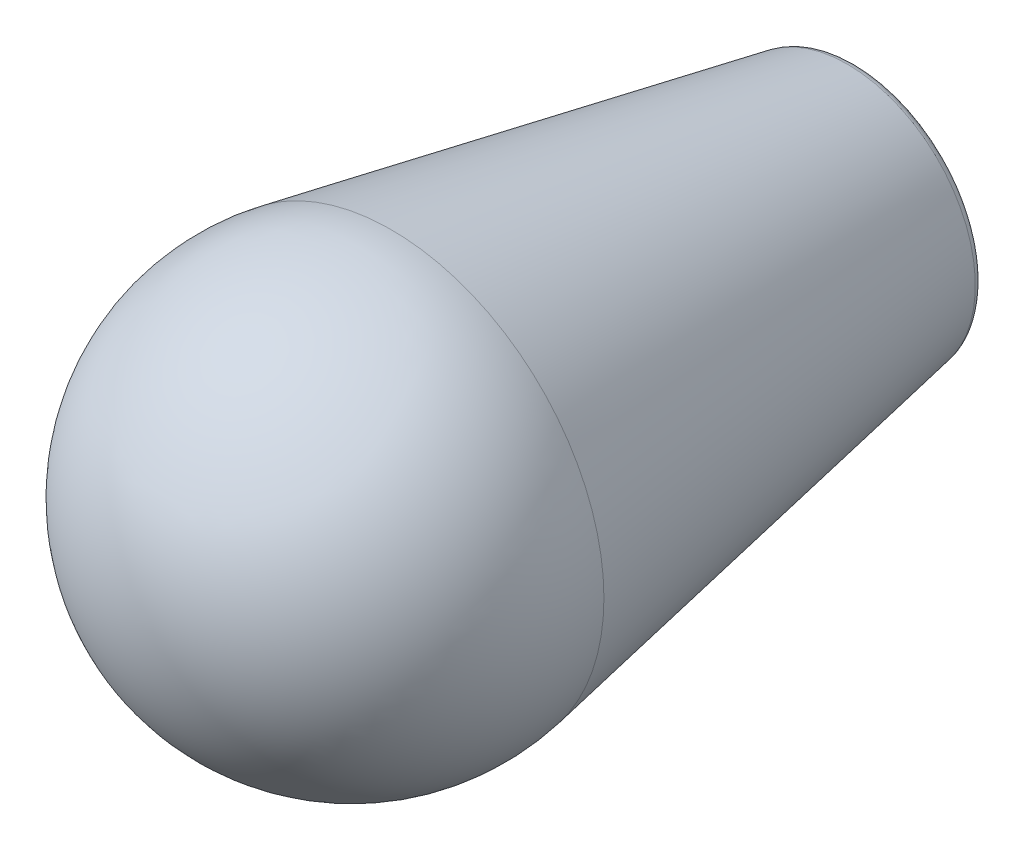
ISO-10303-21;
HEADER;
FILE_DESCRIPTION(('STEP AP214'),'2;1');
FILE_NAME('part.step','',(''),(''),'','','');
FILE_SCHEMA(('AUTOMOTIVE_DESIGN { 1 0 10303 214 1 1 1 1 }'));
ENDSEC;
DATA;
#1=APPLICATION_CONTEXT('core data for automotive mechanical design processes');
#2=APPLICATION_PROTOCOL_DEFINITION('international standard','automotive_design',2000,#1);
#3=PRODUCT_CONTEXT('',#1,'mechanical');
#4=PRODUCT('Part','Part','',(#3));
#5=PRODUCT_RELATED_PRODUCT_CATEGORY('part','',(#4));
#6=PRODUCT_DEFINITION_FORMATION('','',#4);
#7=PRODUCT_DEFINITION_CONTEXT('part definition',#1,'design');
#8=PRODUCT_DEFINITION('design','',#6,#7);
#9=PRODUCT_DEFINITION_SHAPE('','',#8);
#10=(LENGTH_UNIT() NAMED_UNIT(*) SI_UNIT(.MILLI.,.METRE.));
#11=(NAMED_UNIT(*) PLANE_ANGLE_UNIT() SI_UNIT($,.RADIAN.));
#12=(NAMED_UNIT(*) SI_UNIT($,.STERADIAN.) SOLID_ANGLE_UNIT());
#13=UNCERTAINTY_MEASURE_WITH_UNIT(LENGTH_MEASURE(1.E-05),#10,'distance_accuracy_value','');
#14=(GEOMETRIC_REPRESENTATION_CONTEXT(3) GLOBAL_UNCERTAINTY_ASSIGNED_CONTEXT((#13)) GLOBAL_UNIT_ASSIGNED_CONTEXT((#10,
#11,#12)) REPRESENTATION_CONTEXT('',''));
#15=CARTESIAN_POINT('',(0.,0.,0.));
#16=DIRECTION('',(0.,0.,1.));
#17=DIRECTION('',(1.,0.,0.));
#18=AXIS2_PLACEMENT_3D('',#15,#16,#17);
#19=CARTESIAN_POINT('',(0.,0.,28.));
#20=DIRECTION('',(0.,0.,1.));
#21=DIRECTION('',(1.,0.,0.));
#22=AXIS2_PLACEMENT_3D('',#19,#20,#21);
#23=SPHERICAL_SURFACE('',#22,12.);
#24=CARTESIAN_POINT('',(0.,0.,25.8066026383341));
#25=DIRECTION('',(0.,0.,1.));
#26=DIRECTION('',(0.,-1.,0.));
#27=AXIS2_PLACEMENT_3D('',#24,#25,#26);
#28=CIRCLE('',#27,11.7978391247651);
#29=CARTESIAN_POINT('',(0.,-11.7978391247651,25.8066026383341));
#30=VERTEX_POINT('',#29);
#31=EDGE_CURVE('E37',#30,#30,#28,.T.);
#32=ORIENTED_EDGE('',*,*,#31,.T.);
#33=EDGE_LOOP('',(#32));
#34=FACE_BOUND('',#33,.T.);
#35=ADVANCED_FACE('F12',(#34),#23,.T.);
#36=CARTESIAN_POINT('',(4.,0.,28.));
#37=DIRECTION('',(0.,0.,1.));
#38=DIRECTION('',(0.,-1.,0.));
#39=AXIS2_PLACEMENT_3D('',#36,#37,#38);
#40=PLANE('',#39);
#41=CARTESIAN_POINT('',(0.,0.,28.));
#42=DIRECTION('',(0.,0.,1.));
#43=DIRECTION('',(0.,-1.,0.));
#44=AXIS2_PLACEMENT_3D('',#41,#42,#43);
#45=CIRCLE('',#44,4.);
#46=CARTESIAN_POINT('',(0.,-4.,28.));
#47=VERTEX_POINT('',#46);
#48=EDGE_CURVE('E8',#47,#47,#45,.T.);
#49=ORIENTED_EDGE('',*,*,#48,.F.);
#50=EDGE_LOOP('',(#49));
#51=FACE_BOUND('',#50,.T.);
#52=ADVANCED_FACE('F75',(#51),#40,.F.);
#53=CARTESIAN_POINT('',(0.,0.,40.));
#54=DIRECTION('',(0.,0.,1.));
#55=DIRECTION('',(0.,-1.,0.));
#56=AXIS2_PLACEMENT_3D('',#53,#54,#55);
#57=CYLINDRICAL_SURFACE('',#56,4.);
#58=CARTESIAN_POINT('',(0.,0.,3.5));
#59=DIRECTION('',(0.,0.,1.));
#60=DIRECTION('',(0.,-1.,0.));
#61=AXIS2_PLACEMENT_3D('',#58,#59,#60);
#62=CIRCLE('',#61,4.);
#63=CARTESIAN_POINT('',(0.,-4.,3.5));
#64=VERTEX_POINT('',#63);
#65=EDGE_CURVE('E18',#64,#64,#62,.T.);
#66=ORIENTED_EDGE('',*,*,#65,.F.);
#67=EDGE_LOOP('',(#66));
#68=FACE_BOUND('',#67,.T.);
#69=ORIENTED_EDGE('',*,*,#48,.T.);
#70=EDGE_LOOP('',(#69));
#71=FACE_BOUND('',#70,.T.);
#72=ADVANCED_FACE('F68',(#68,#71),#57,.F.);
#73=CARTESIAN_POINT('',(4.25,0.,3.5));
#74=DIRECTION('',(0.,0.,1.));
#75=DIRECTION('',(0.,-1.,0.));
#76=AXIS2_PLACEMENT_3D('',#73,#74,#75);
#77=PLANE('',#76);
#78=CARTESIAN_POINT('',(0.,0.,3.5));
#79=DIRECTION('',(0.,0.,1.));
#80=DIRECTION('',(0.,-1.,0.));
#81=AXIS2_PLACEMENT_3D('',#78,#79,#80);
#82=CIRCLE('',#81,4.25);
#83=CARTESIAN_POINT('',(0.,-4.25,3.5));
#84=VERTEX_POINT('',#83);
#85=EDGE_CURVE('E22',#84,#84,#82,.T.);
#86=ORIENTED_EDGE('',*,*,#85,.F.);
#87=EDGE_LOOP('',(#86));
#88=FACE_BOUND('',#87,.T.);
#89=ORIENTED_EDGE('',*,*,#65,.T.);
#90=EDGE_LOOP('',(#89));
#91=FACE_BOUND('',#90,.T.);
#92=ADVANCED_FACE('F63',(#88,#91),#77,.F.);
#93=CARTESIAN_POINT('',(0.,0.,40.));
#94=DIRECTION('',(0.,0.,1.));
#95=DIRECTION('',(0.,-1.,0.));
#96=AXIS2_PLACEMENT_3D('',#93,#94,#95);
#97=CYLINDRICAL_SURFACE('',#96,4.25);
#98=CARTESIAN_POINT('',(0.,0.,0.));
#99=DIRECTION('',(0.,0.,1.));
#100=DIRECTION('',(0.,-1.,0.));
#101=AXIS2_PLACEMENT_3D('',#98,#99,#100);
#102=CIRCLE('',#101,4.25);
#103=CARTESIAN_POINT('',(0.,-4.25,0.));
#104=VERTEX_POINT('',#103);
#105=EDGE_CURVE('E26',#104,#104,#102,.T.);
#106=ORIENTED_EDGE('',*,*,#105,.F.);
#107=EDGE_LOOP('',(#106));
#108=FACE_BOUND('',#107,.T.);
#109=ORIENTED_EDGE('',*,*,#85,.T.);
#110=EDGE_LOOP('',(#109));
#111=FACE_BOUND('',#110,.T.);
#112=ADVANCED_FACE('F57',(#108,#111),#97,.F.);
#113=CARTESIAN_POINT('',(4.25,0.,0.));
#114=DIRECTION('',(0.,0.,1.));
#115=DIRECTION('',(0.,-1.,0.));
#116=AXIS2_PLACEMENT_3D('',#113,#114,#115);
#117=PLANE('',#116);
#118=CARTESIAN_POINT('',(0.,0.,0.));
#119=DIRECTION('',(0.,0.,1.));
#120=DIRECTION('',(0.,-1.,0.));
#121=AXIS2_PLACEMENT_3D('',#118,#119,#120);
#122=CIRCLE('',#121,6.50126785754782);
#123=CARTESIAN_POINT('',(0.,-6.50126785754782,0.));
#124=VERTEX_POINT('',#123);
#125=EDGE_CURVE('E31',#124,#124,#122,.T.);
#126=ORIENTED_EDGE('',*,*,#125,.F.);
#127=EDGE_LOOP('',(#126));
#128=FACE_BOUND('',#127,.T.);
#129=ORIENTED_EDGE('',*,*,#105,.T.);
#130=EDGE_LOOP('',(#129));
#131=FACE_BOUND('',#130,.T.);
#132=ADVANCED_FACE('F51',(#128,#131),#117,.F.);
#133=CARTESIAN_POINT('',(0.,0.,0.600000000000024));
#134=DIRECTION('',(0.,0.,1.));
#135=DIRECTION('',(0.,-1.,0.));
#136=AXIS2_PLACEMENT_3D('',#133,#134,#135);
#137=TOROIDAL_SURFACE('',#136,6.50126785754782,0.6);
#138=CARTESIAN_POINT('',(0.,0.,0.490330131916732));
#139=DIRECTION('',(0.,0.,1.));
#140=DIRECTION('',(0.,-1.,0.));
#141=AXIS2_PLACEMENT_3D('',#138,#139,#140);
#142=CIRCLE('',#141,7.09115981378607);
#143=CARTESIAN_POINT('',(0.,-7.09115981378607,0.490330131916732));
#144=VERTEX_POINT('',#143);
#145=EDGE_CURVE('E34',#144,#144,#142,.T.);
#146=ORIENTED_EDGE('',*,*,#145,.F.);
#147=EDGE_LOOP('',(#146));
#148=FACE_BOUND('',#147,.T.);
#149=ORIENTED_EDGE('',*,*,#125,.T.);
#150=EDGE_LOOP('',(#149));
#151=FACE_BOUND('',#150,.T.);
#152=ADVANCED_FACE('F45',(#148,#151),#137,.T.);
#153=CARTESIAN_POINT('',(0.,0.,0.490330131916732));
#154=DIRECTION('',(0.,0.,1.));
#155=DIRECTION('',(0.,-1.,0.));
#156=AXIS2_PLACEMENT_3D('',#153,#154,#155);
#157=CONICAL_SURFACE('',#156,7.09115981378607,0.183816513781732);
#158=ORIENTED_EDGE('',*,*,#31,.F.);
#159=EDGE_LOOP('',(#158));
#160=FACE_BOUND('',#159,.T.);
#161=ORIENTED_EDGE('',*,*,#145,.T.);
#162=EDGE_LOOP('',(#161));
#163=FACE_BOUND('',#162,.T.);
#164=ADVANCED_FACE('F42',(#160,#163),#157,.T.);
#165=CLOSED_SHELL('',(#35,#52,#72,#92,#112,#132,#152,#164));
#166=MANIFOLD_SOLID_BREP('B1',#165);
#167=ADVANCED_BREP_SHAPE_REPRESENTATION('',(#18,#166),#14);
#168=SHAPE_DEFINITION_REPRESENTATION(#9,#167);
ENDSEC;
END-ISO-10303-21;
